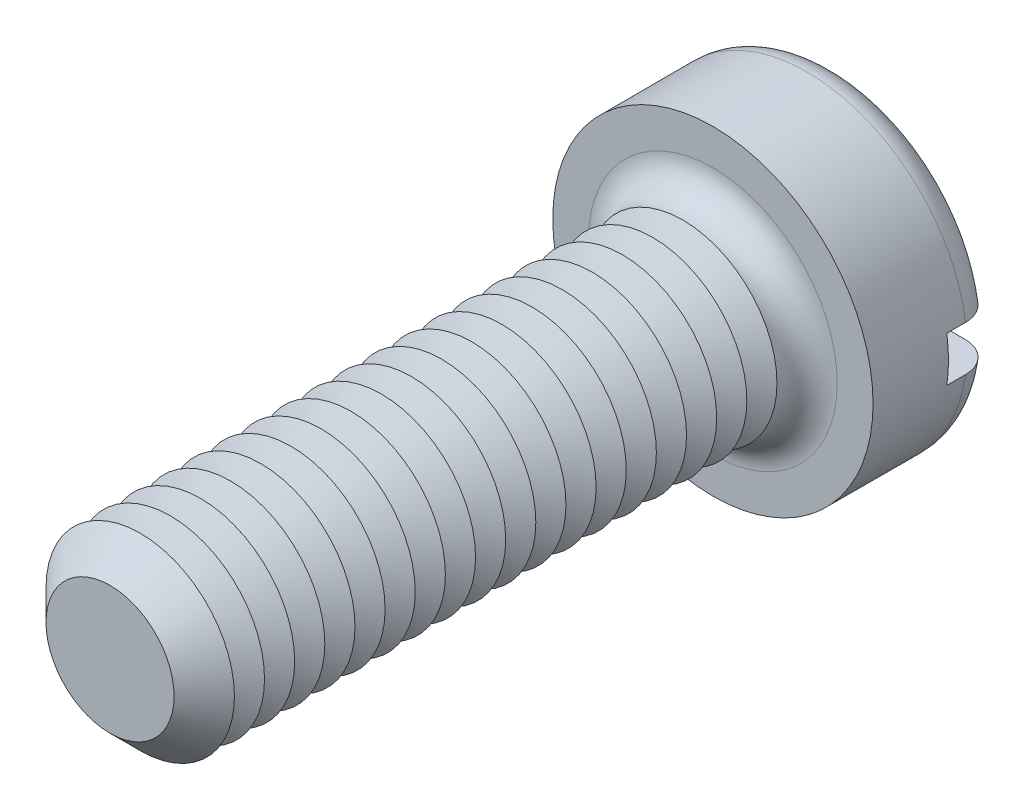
from build123d import *

# Parameters (mm, degrees)
SKETCH3_R           = 4.25
BOSS_EXTRUDE2_DEPTH = 3.3
SKETCH4_R           = 2.5
BOSS_EXTRUDE3_DEPTH = 16
FILLET1_R           = 0.8
CHAMFER1_SIZE       = 0.8
LPATTERN1_COUNT     = 18
LPATTERN1_PITCH     = 0.8
SKETCH8_W           = 8.5
SKETCH8_H           = 1.2
CUT_EXTRUDE1_DEPTH  = 1.3


with BuildPart() as part:
    # Sketch3 → Boss-Extrude2 (new body)
    with BuildSketch(Plane.XY):
        Circle(SKETCH3_R)
    extrude(amount=-BOSS_EXTRUDE2_DEPTH)

    # Sketch4 → Boss-Extrude3 (add)
    with BuildSketch(Plane.XY):
        Circle(SKETCH4_R)
    extrude(amount=BOSS_EXTRUDE3_DEPTH)

    # Fillet1
    fillet1_edges = [part.edges().sort_by_distance(p)[0] for p in [
        (-4.25, 0, -3.3),
        (-2.5, 0, 0),
    ]]
    fillet(fillet1_edges, radius=FILLET1_R)

    # Chamfer1
    chamfer1_edges = [part.edges().sort_by_distance(p)[0] for p in [
        (-2.5, 0, 16),
    ]]
    chamfer(chamfer1_edges, length=CHAMFER1_SIZE)

    # Sketch6 → Cut-Revolve1 (revolve, cut)
    with BuildSketch(Plane(origin=(0, 0, 0), x_dir=(0, 0, -1), z_dir=(1, 0, 0)), mode=Mode.PRIVATE) as cut_revolve1_sk:
        Polygon((-0.8, 2.5), (-1.2, 1.807179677), (-1.6, 2.5), align=None)
    cut_revolve1 = revolve(cut_revolve1_sk.sketch.rotate(Axis((0, 0, -1.694361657), (0, 0, 1)), 90), axis=Axis((0, 0, -1.694361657), (0, 0, 1)), mode=Mode.SUBTRACT)

    # LPattern1: Cut-Revolve1 ×18
    with Locations(*[(0, 0, i * LPATTERN1_PITCH) for i in range(1, LPATTERN1_COUNT)]):
        add(cut_revolve1, mode=Mode.SUBTRACT)

    # Sketch8 → Cut-Extrude1 (cut)
    with BuildSketch(Plane(origin=(0, 0, -3.3), x_dir=(-1, 0, 0), z_dir=(0, 0, -1))):
        Rectangle(SKETCH8_W, SKETCH8_H)
    extrude(amount=-CUT_EXTRUDE1_DEPTH, mode=Mode.SUBTRACT)


solid = part.part
